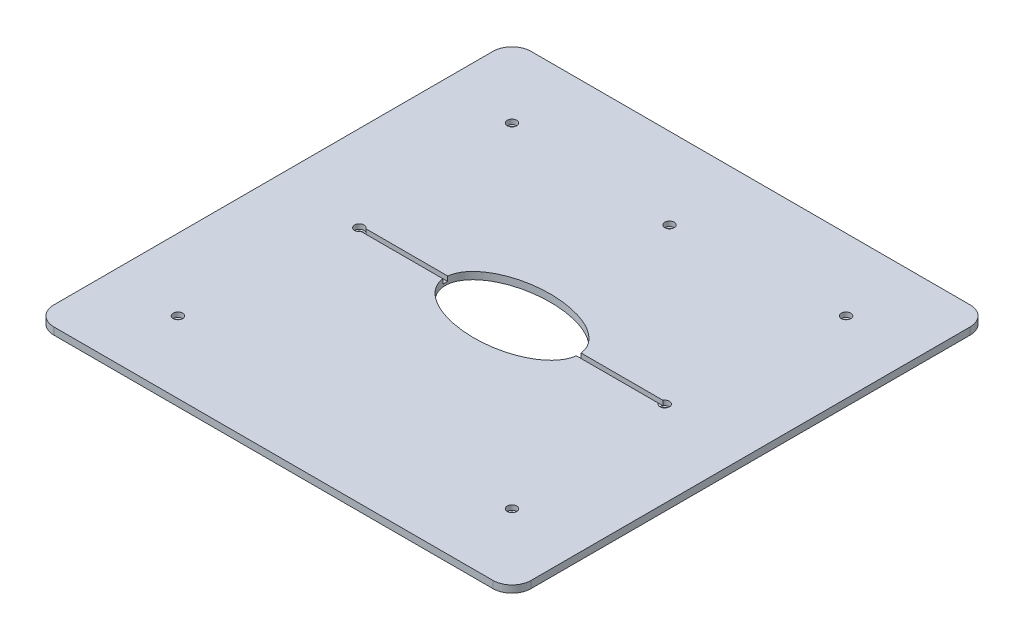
ISO-10303-21;
HEADER;
FILE_DESCRIPTION(('STEP AP214'),'2;1');
FILE_NAME('part.step','',(''),(''),'','','');
FILE_SCHEMA(('AUTOMOTIVE_DESIGN { 1 0 10303 214 1 1 1 1 }'));
ENDSEC;
DATA;
#1=APPLICATION_CONTEXT('core data for automotive mechanical design processes');
#2=APPLICATION_PROTOCOL_DEFINITION('international standard','automotive_design',2000,#1);
#3=PRODUCT_CONTEXT('',#1,'mechanical');
#4=PRODUCT('Part','Part','',(#3));
#5=PRODUCT_RELATED_PRODUCT_CATEGORY('part','',(#4));
#6=PRODUCT_DEFINITION_FORMATION('','',#4);
#7=PRODUCT_DEFINITION_CONTEXT('part definition',#1,'design');
#8=PRODUCT_DEFINITION('design','',#6,#7);
#9=PRODUCT_DEFINITION_SHAPE('','',#8);
#10=(LENGTH_UNIT() NAMED_UNIT(*) SI_UNIT(.MILLI.,.METRE.));
#11=(NAMED_UNIT(*) PLANE_ANGLE_UNIT() SI_UNIT($,.RADIAN.));
#12=(NAMED_UNIT(*) SI_UNIT($,.STERADIAN.) SOLID_ANGLE_UNIT());
#13=UNCERTAINTY_MEASURE_WITH_UNIT(LENGTH_MEASURE(1.E-05),#10,'distance_accuracy_value','');
#14=(GEOMETRIC_REPRESENTATION_CONTEXT(3) GLOBAL_UNCERTAINTY_ASSIGNED_CONTEXT((#13)) GLOBAL_UNIT_ASSIGNED_CONTEXT((#10,
#11,#12)) REPRESENTATION_CONTEXT('',''));
#15=CARTESIAN_POINT('',(0.,0.,0.));
#16=DIRECTION('',(0.,0.,1.));
#17=DIRECTION('',(1.,0.,0.));
#18=AXIS2_PLACEMENT_3D('',#15,#16,#17);
#19=CARTESIAN_POINT('',(-46.,1.5,46.));
#20=DIRECTION('',(0.,-1.,0.));
#21=DIRECTION('',(0.,0.,-1.));
#22=AXIS2_PLACEMENT_3D('',#19,#20,#21);
#23=CYLINDRICAL_SURFACE('',#22,4.);
#24=CARTESIAN_POINT('',(-46.,0.,46.));
#25=DIRECTION('',(0.,1.,0.));
#26=DIRECTION('',(0.,0.,-1.));
#27=AXIS2_PLACEMENT_3D('',#24,#25,#26);
#28=CIRCLE('',#27,4.);
#29=CARTESIAN_POINT('',(-50.,0.,46.));
#30=VERTEX_POINT('',#29);
#31=CARTESIAN_POINT('',(-45.9999999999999,0.,50.));
#32=VERTEX_POINT('',#31);
#33=EDGE_CURVE('E311',#30,#32,#28,.T.);
#34=ORIENTED_EDGE('',*,*,#33,.T.);
#35=DIRECTION('',(0.,-1.,0.));
#36=VECTOR('',#35,1.);
#37=CARTESIAN_POINT('',(-45.9999999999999,1.5,50.));
#38=LINE('',#37,#36);
#39=CARTESIAN_POINT('',(-45.9999999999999,1.5,50.));
#40=VERTEX_POINT('',#39);
#41=EDGE_CURVE('E305',#40,#32,#38,.T.);
#42=ORIENTED_EDGE('',*,*,#41,.F.);
#43=CARTESIAN_POINT('',(-46.,1.5,46.));
#44=DIRECTION('',(0.,1.,0.));
#45=DIRECTION('',(0.,0.,-1.));
#46=AXIS2_PLACEMENT_3D('',#43,#44,#45);
#47=CIRCLE('',#46,4.);
#48=CARTESIAN_POINT('',(-50.,1.5,46.));
#49=VERTEX_POINT('',#48);
#50=EDGE_CURVE('E333',#49,#40,#47,.T.);
#51=ORIENTED_EDGE('',*,*,#50,.F.);
#52=DIRECTION('',(0.,-1.,0.));
#53=VECTOR('',#52,1.);
#54=CARTESIAN_POINT('',(-50.,1.5,46.));
#55=LINE('',#54,#53);
#56=EDGE_CURVE('E334',#49,#30,#55,.T.);
#57=ORIENTED_EDGE('',*,*,#56,.T.);
#58=EDGE_LOOP('',(#34,#42,#51,#57));
#59=FACE_BOUND('',#58,.T.);
#60=ADVANCED_FACE('F41',(#59),#23,.T.);
#61=CARTESIAN_POINT('',(46.,1.5,50.));
#62=DIRECTION('',(0.,0.,-1.));
#63=DIRECTION('',(-1.,0.,0.));
#64=AXIS2_PLACEMENT_3D('',#61,#62,#63);
#65=PLANE('',#64);
#66=DIRECTION('',(1.,0.,0.));
#67=VECTOR('',#66,1.);
#68=CARTESIAN_POINT('',(46.,0.,50.));
#69=LINE('',#68,#67);
#70=CARTESIAN_POINT('',(46.,0.,50.));
#71=VERTEX_POINT('',#70);
#72=EDGE_CURVE('E300',#32,#71,#69,.T.);
#73=ORIENTED_EDGE('',*,*,#72,.T.);
#74=DIRECTION('',(0.,-1.,0.));
#75=VECTOR('',#74,1.);
#76=CARTESIAN_POINT('',(46.,1.5,50.));
#77=LINE('',#76,#75);
#78=CARTESIAN_POINT('',(46.,1.5,50.));
#79=VERTEX_POINT('',#78);
#80=EDGE_CURVE('E302',#79,#71,#77,.T.);
#81=ORIENTED_EDGE('',*,*,#80,.F.);
#82=DIRECTION('',(1.,0.,0.));
#83=VECTOR('',#82,1.);
#84=CARTESIAN_POINT('',(46.,1.5,50.));
#85=LINE('',#84,#83);
#86=EDGE_CURVE('E867',#40,#79,#85,.T.);
#87=ORIENTED_EDGE('',*,*,#86,.F.);
#88=ORIENTED_EDGE('',*,*,#41,.T.);
#89=EDGE_LOOP('',(#73,#81,#87,#88));
#90=FACE_BOUND('',#89,.T.);
#91=ADVANCED_FACE('F290',(#90),#65,.F.);
#92=CARTESIAN_POINT('',(46.,1.5,46.));
#93=DIRECTION('',(0.,-1.,0.));
#94=DIRECTION('',(0.,0.,-1.));
#95=AXIS2_PLACEMENT_3D('',#92,#93,#94);
#96=CYLINDRICAL_SURFACE('',#95,4.);
#97=CARTESIAN_POINT('',(46.,0.,46.));
#98=DIRECTION('',(0.,1.,0.));
#99=DIRECTION('',(0.,0.,1.));
#100=AXIS2_PLACEMENT_3D('',#97,#98,#99);
#101=CIRCLE('',#100,4.);
#102=CARTESIAN_POINT('',(50.,0.,46.));
#103=VERTEX_POINT('',#102);
#104=EDGE_CURVE('E310',#71,#103,#101,.T.);
#105=ORIENTED_EDGE('',*,*,#104,.T.);
#106=DIRECTION('',(0.,-1.,0.));
#107=VECTOR('',#106,1.);
#108=CARTESIAN_POINT('',(50.,1.5,46.));
#109=LINE('',#108,#107);
#110=CARTESIAN_POINT('',(50.,1.5,46.));
#111=VERTEX_POINT('',#110);
#112=EDGE_CURVE('E316',#111,#103,#109,.T.);
#113=ORIENTED_EDGE('',*,*,#112,.F.);
#114=CARTESIAN_POINT('',(46.,1.5,46.));
#115=DIRECTION('',(0.,1.,0.));
#116=DIRECTION('',(0.,0.,1.));
#117=AXIS2_PLACEMENT_3D('',#114,#115,#116);
#118=CIRCLE('',#117,4.);
#119=EDGE_CURVE('E315',#79,#111,#118,.T.);
#120=ORIENTED_EDGE('',*,*,#119,.F.);
#121=ORIENTED_EDGE('',*,*,#80,.T.);
#122=EDGE_LOOP('',(#105,#113,#120,#121));
#123=FACE_BOUND('',#122,.T.);
#124=ADVANCED_FACE('F287',(#123),#96,.T.);
#125=CARTESIAN_POINT('',(50.,1.5,46.));
#126=DIRECTION('',(-1.,0.,0.));
#127=DIRECTION('',(0.,0.,1.));
#128=AXIS2_PLACEMENT_3D('',#125,#126,#127);
#129=PLANE('',#128);
#130=DIRECTION('',(0.,0.,-1.));
#131=VECTOR('',#130,1.);
#132=CARTESIAN_POINT('',(50.,0.,46.));
#133=LINE('',#132,#131);
#134=CARTESIAN_POINT('',(50.,0.,-46.));
#135=VERTEX_POINT('',#134);
#136=EDGE_CURVE('E320',#103,#135,#133,.T.);
#137=ORIENTED_EDGE('',*,*,#136,.T.);
#138=DIRECTION('',(0.,-1.,0.));
#139=VECTOR('',#138,1.);
#140=CARTESIAN_POINT('',(50.,1.5,-46.));
#141=LINE('',#140,#139);
#142=CARTESIAN_POINT('',(50.,1.5,-46.));
#143=VERTEX_POINT('',#142);
#144=EDGE_CURVE('E347',#143,#135,#141,.T.);
#145=ORIENTED_EDGE('',*,*,#144,.F.);
#146=DIRECTION('',(0.,0.,-1.));
#147=VECTOR('',#146,1.);
#148=CARTESIAN_POINT('',(50.,1.5,46.));
#149=LINE('',#148,#147);
#150=EDGE_CURVE('E881',#111,#143,#149,.T.);
#151=ORIENTED_EDGE('',*,*,#150,.F.);
#152=ORIENTED_EDGE('',*,*,#112,.T.);
#153=EDGE_LOOP('',(#137,#145,#151,#152));
#154=FACE_BOUND('',#153,.T.);
#155=ADVANCED_FACE('F283',(#154),#129,.F.);
#156=CARTESIAN_POINT('',(46.,1.5,-46.));
#157=DIRECTION('',(0.,-1.,0.));
#158=DIRECTION('',(0.,0.,-1.));
#159=AXIS2_PLACEMENT_3D('',#156,#157,#158);
#160=CYLINDRICAL_SURFACE('',#159,4.);
#161=CARTESIAN_POINT('',(46.,0.,-46.));
#162=DIRECTION('',(0.,1.,0.));
#163=DIRECTION('',(0.,0.,-1.));
#164=AXIS2_PLACEMENT_3D('',#161,#162,#163);
#165=CIRCLE('',#164,4.);
#166=CARTESIAN_POINT('',(46.,0.,-50.));
#167=VERTEX_POINT('',#166);
#168=EDGE_CURVE('E322',#135,#167,#165,.T.);
#169=ORIENTED_EDGE('',*,*,#168,.T.);
#170=DIRECTION('',(0.,-1.,0.));
#171=VECTOR('',#170,1.);
#172=CARTESIAN_POINT('',(46.,1.5,-50.));
#173=LINE('',#172,#171);
#174=CARTESIAN_POINT('',(46.,1.5,-50.));
#175=VERTEX_POINT('',#174);
#176=EDGE_CURVE('E344',#175,#167,#173,.T.);
#177=ORIENTED_EDGE('',*,*,#176,.F.);
#178=CARTESIAN_POINT('',(46.,1.5,-46.));
#179=DIRECTION('',(0.,1.,0.));
#180=DIRECTION('',(0.,0.,-1.));
#181=AXIS2_PLACEMENT_3D('',#178,#179,#180);
#182=CIRCLE('',#181,4.);
#183=EDGE_CURVE('E879',#143,#175,#182,.T.);
#184=ORIENTED_EDGE('',*,*,#183,.F.);
#185=ORIENTED_EDGE('',*,*,#144,.T.);
#186=EDGE_LOOP('',(#169,#177,#184,#185));
#187=FACE_BOUND('',#186,.T.);
#188=ADVANCED_FACE('F279',(#187),#160,.T.);
#189=CARTESIAN_POINT('',(46.,1.5,-50.));
#190=DIRECTION('',(0.,0.,1.));
#191=DIRECTION('',(1.,0.,0.));
#192=AXIS2_PLACEMENT_3D('',#189,#190,#191);
#193=PLANE('',#192);
#194=DIRECTION('',(-1.,0.,0.));
#195=VECTOR('',#194,1.);
#196=CARTESIAN_POINT('',(46.,0.,-50.));
#197=LINE('',#196,#195);
#198=CARTESIAN_POINT('',(-45.9999999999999,0.,-50.));
#199=VERTEX_POINT('',#198);
#200=EDGE_CURVE('E327',#167,#199,#197,.T.);
#201=ORIENTED_EDGE('',*,*,#200,.T.);
#202=DIRECTION('',(0.,-1.,0.));
#203=VECTOR('',#202,1.);
#204=CARTESIAN_POINT('',(-45.9999999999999,1.5,-50.));
#205=LINE('',#204,#203);
#206=CARTESIAN_POINT('',(-45.9999999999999,1.5,-50.));
#207=VERTEX_POINT('',#206);
#208=EDGE_CURVE('E341',#207,#199,#205,.T.);
#209=ORIENTED_EDGE('',*,*,#208,.F.);
#210=DIRECTION('',(-1.,0.,0.));
#211=VECTOR('',#210,1.);
#212=CARTESIAN_POINT('',(46.,1.5,-50.));
#213=LINE('',#212,#211);
#214=EDGE_CURVE('E877',#175,#207,#213,.T.);
#215=ORIENTED_EDGE('',*,*,#214,.F.);
#216=ORIENTED_EDGE('',*,*,#176,.T.);
#217=EDGE_LOOP('',(#201,#209,#215,#216));
#218=FACE_BOUND('',#217,.T.);
#219=ADVANCED_FACE('F275',(#218),#193,.F.);
#220=CARTESIAN_POINT('',(-46.,1.5,-46.));
#221=DIRECTION('',(0.,-1.,0.));
#222=DIRECTION('',(0.,0.,-1.));
#223=AXIS2_PLACEMENT_3D('',#220,#221,#222);
#224=CYLINDRICAL_SURFACE('',#223,4.);
#225=CARTESIAN_POINT('',(-46.,0.,-46.));
#226=DIRECTION('',(0.,1.,0.));
#227=DIRECTION('',(0.,0.,-1.));
#228=AXIS2_PLACEMENT_3D('',#225,#226,#227);
#229=CIRCLE('',#228,4.);
#230=CARTESIAN_POINT('',(-50.,0.,-46.));
#231=VERTEX_POINT('',#230);
#232=EDGE_CURVE('E329',#199,#231,#229,.T.);
#233=ORIENTED_EDGE('',*,*,#232,.T.);
#234=DIRECTION('',(0.,-1.,0.));
#235=VECTOR('',#234,1.);
#236=CARTESIAN_POINT('',(-50.,1.5,-46.));
#237=LINE('',#236,#235);
#238=CARTESIAN_POINT('',(-50.,1.5,-46.));
#239=VERTEX_POINT('',#238);
#240=EDGE_CURVE('E337',#239,#231,#237,.T.);
#241=ORIENTED_EDGE('',*,*,#240,.F.);
#242=CARTESIAN_POINT('',(-46.,1.5,-46.));
#243=DIRECTION('',(0.,1.,0.));
#244=DIRECTION('',(0.,0.,-1.));
#245=AXIS2_PLACEMENT_3D('',#242,#243,#244);
#246=CIRCLE('',#245,4.);
#247=EDGE_CURVE('E875',#207,#239,#246,.T.);
#248=ORIENTED_EDGE('',*,*,#247,.F.);
#249=ORIENTED_EDGE('',*,*,#208,.T.);
#250=EDGE_LOOP('',(#233,#241,#248,#249));
#251=FACE_BOUND('',#250,.T.);
#252=ADVANCED_FACE('F271',(#251),#224,.T.);
#253=CARTESIAN_POINT('',(-50.,1.5,46.));
#254=DIRECTION('',(1.,0.,0.));
#255=DIRECTION('',(0.,0.,-1.));
#256=AXIS2_PLACEMENT_3D('',#253,#254,#255);
#257=PLANE('',#256);
#258=DIRECTION('',(0.,0.,1.));
#259=VECTOR('',#258,1.);
#260=CARTESIAN_POINT('',(-50.,0.,46.));
#261=LINE('',#260,#259);
#262=EDGE_CURVE('E331',#231,#30,#261,.T.);
#263=ORIENTED_EDGE('',*,*,#262,.T.);
#264=ORIENTED_EDGE('',*,*,#56,.F.);
#265=DIRECTION('',(0.,0.,1.));
#266=VECTOR('',#265,1.);
#267=CARTESIAN_POINT('',(-50.,1.5,46.));
#268=LINE('',#267,#266);
#269=EDGE_CURVE('E338',#239,#49,#268,.T.);
#270=ORIENTED_EDGE('',*,*,#269,.F.);
#271=ORIENTED_EDGE('',*,*,#240,.T.);
#272=EDGE_LOOP('',(#263,#264,#270,#271));
#273=FACE_BOUND('',#272,.T.);
#274=ADVANCED_FACE('F264',(#273),#257,.F.);
#275=CARTESIAN_POINT('',(-46.,1.5,46.));
#276=DIRECTION('',(0.,-1.,0.));
#277=DIRECTION('',(0.,0.,-1.));
#278=AXIS2_PLACEMENT_3D('',#275,#276,#277);
#279=PLANE('',#278);
#280=CARTESIAN_POINT('',(0.,1.5,-33.));
#281=DIRECTION('',(0.,1.,0.));
#282=DIRECTION('',(0.,0.,1.));
#283=AXIS2_PLACEMENT_3D('',#280,#281,#282);
#284=CIRCLE('',#283,1.);
#285=CARTESIAN_POINT('',(0.,1.5,-32.));
#286=VERTEX_POINT('',#285);
#287=EDGE_CURVE('E397',#286,#286,#284,.T.);
#288=ORIENTED_EDGE('',*,*,#287,.F.);
#289=EDGE_LOOP('',(#288));
#290=FACE_BOUND('',#289,.T.);
#291=DIRECTION('',(1.,0.,0.));
#292=VECTOR('',#291,1.);
#293=CARTESIAN_POINT('',(32.,1.5,0.499999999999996));
#294=LINE('',#293,#292);
#295=CARTESIAN_POINT('',(-31.1339745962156,1.5,0.500000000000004));
#296=VERTEX_POINT('',#295);
#297=CARTESIAN_POINT('',(-13.9726294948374,1.5,0.500000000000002));
#298=VERTEX_POINT('',#297);
#299=EDGE_CURVE('E193',#296,#298,#294,.T.);
#300=ORIENTED_EDGE('',*,*,#299,.F.);
#301=CARTESIAN_POINT('',(-32.,1.5,0.));
#302=DIRECTION('',(0.,1.,0.));
#303=DIRECTION('',(0.,0.,1.));
#304=AXIS2_PLACEMENT_3D('',#301,#302,#303);
#305=CIRCLE('',#304,1.);
#306=CARTESIAN_POINT('',(-31.1339745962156,1.5,-0.499999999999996));
#307=VERTEX_POINT('',#306);
#308=EDGE_CURVE('E163',#307,#296,#305,.T.);
#309=ORIENTED_EDGE('',*,*,#308,.F.);
#310=DIRECTION('',(-1.,0.,0.));
#311=VECTOR('',#310,1.);
#312=CARTESIAN_POINT('',(32.,1.5,-0.500000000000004));
#313=LINE('',#312,#311);
#314=CARTESIAN_POINT('',(-13.9726294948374,1.5,-0.499999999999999));
#315=VERTEX_POINT('',#314);
#316=EDGE_CURVE('E195',#315,#307,#313,.T.);
#317=ORIENTED_EDGE('',*,*,#316,.F.);
#318=CARTESIAN_POINT('',(0.,1.5,0.));
#319=DIRECTION('',(0.,1.,0.));
#320=DIRECTION('',(-1.,0.,0.));
#321=AXIS2_PLACEMENT_3D('',#318,#319,#320);
#322=ELLIPSE('',#321,14.,8.);
#323=CARTESIAN_POINT('',(13.9726294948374,1.5,-0.500000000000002));
#324=VERTEX_POINT('',#323);
#325=EDGE_CURVE('E192',#324,#315,#322,.T.);
#326=ORIENTED_EDGE('',*,*,#325,.F.);
#327=CARTESIAN_POINT('',(31.1339745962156,1.5,-0.500000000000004));
#328=VERTEX_POINT('',#327);
#329=EDGE_CURVE('E189',#328,#324,#313,.T.);
#330=ORIENTED_EDGE('',*,*,#329,.F.);
#331=CARTESIAN_POINT('',(32.,1.5,0.));
#332=DIRECTION('',(0.,1.,0.));
#333=DIRECTION('',(0.,0.,1.));
#334=AXIS2_PLACEMENT_3D('',#331,#332,#333);
#335=CIRCLE('',#334,0.999999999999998);
#336=CARTESIAN_POINT('',(31.1339745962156,1.5,0.499999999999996));
#337=VERTEX_POINT('',#336);
#338=EDGE_CURVE('E419',#337,#328,#335,.T.);
#339=ORIENTED_EDGE('',*,*,#338,.F.);
#340=CARTESIAN_POINT('',(13.9726294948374,1.5,0.499999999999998));
#341=VERTEX_POINT('',#340);
#342=EDGE_CURVE('E178',#341,#337,#294,.T.);
#343=ORIENTED_EDGE('',*,*,#342,.F.);
#344=EDGE_CURVE('E202',#298,#341,#322,.T.);
#345=ORIENTED_EDGE('',*,*,#344,.F.);
#346=EDGE_LOOP('',(#300,#309,#317,#326,#330,#339,#343,#345));
#347=FACE_BOUND('',#346,.T.);
#348=CARTESIAN_POINT('',(-35.0000000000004,1.5,34.9999999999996));
#349=DIRECTION('',(0.,1.,0.));
#350=DIRECTION('',(0.,0.,1.));
#351=AXIS2_PLACEMENT_3D('',#348,#349,#350);
#352=CIRCLE('',#351,0.999999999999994);
#353=CARTESIAN_POINT('',(-35.0000000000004,1.5,35.9999999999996));
#354=VERTEX_POINT('',#353);
#355=EDGE_CURVE('E366',#354,#354,#352,.T.);
#356=ORIENTED_EDGE('',*,*,#355,.F.);
#357=EDGE_LOOP('',(#356));
#358=FACE_BOUND('',#357,.T.);
#359=CARTESIAN_POINT('',(34.9999999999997,1.5,35.0000000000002));
#360=DIRECTION('',(0.,1.,0.));
#361=DIRECTION('',(0.,0.,1.));
#362=AXIS2_PLACEMENT_3D('',#359,#360,#361);
#363=CIRCLE('',#362,1.);
#364=CARTESIAN_POINT('',(34.9999999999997,1.5,36.0000000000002));
#365=VERTEX_POINT('',#364);
#366=EDGE_CURVE('E856',#365,#365,#363,.T.);
#367=ORIENTED_EDGE('',*,*,#366,.F.);
#368=EDGE_LOOP('',(#367));
#369=FACE_BOUND('',#368,.T.);
#370=CARTESIAN_POINT('',(35.0000000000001,1.5,-34.9999999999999));
#371=DIRECTION('',(0.,1.,0.));
#372=DIRECTION('',(0.,0.,1.));
#373=AXIS2_PLACEMENT_3D('',#370,#371,#372);
#374=CIRCLE('',#373,0.999999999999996);
#375=CARTESIAN_POINT('',(35.0000000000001,1.5,-33.9999999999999));
#376=VERTEX_POINT('',#375);
#377=EDGE_CURVE('E860',#376,#376,#374,.T.);
#378=ORIENTED_EDGE('',*,*,#377,.F.);
#379=EDGE_LOOP('',(#378));
#380=FACE_BOUND('',#379,.T.);
#381=CARTESIAN_POINT('',(-35.,1.5,-35.));
#382=DIRECTION('',(0.,1.,0.));
#383=DIRECTION('',(0.,0.,1.));
#384=AXIS2_PLACEMENT_3D('',#381,#382,#383);
#385=CIRCLE('',#384,0.999999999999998);
#386=CARTESIAN_POINT('',(-35.,1.5,-34.));
#387=VERTEX_POINT('',#386);
#388=EDGE_CURVE('E864',#387,#387,#385,.T.);
#389=ORIENTED_EDGE('',*,*,#388,.F.);
#390=EDGE_LOOP('',(#389));
#391=FACE_BOUND('',#390,.T.);
#392=ORIENTED_EDGE('',*,*,#50,.T.);
#393=ORIENTED_EDGE('',*,*,#86,.T.);
#394=ORIENTED_EDGE('',*,*,#119,.T.);
#395=ORIENTED_EDGE('',*,*,#150,.T.);
#396=ORIENTED_EDGE('',*,*,#183,.T.);
#397=ORIENTED_EDGE('',*,*,#214,.T.);
#398=ORIENTED_EDGE('',*,*,#247,.T.);
#399=ORIENTED_EDGE('',*,*,#269,.T.);
#400=EDGE_LOOP('',(#392,#393,#394,#395,#396,#397,#398,#399));
#401=FACE_BOUND('',#400,.T.);
#402=ADVANCED_FACE('F261',(#290,#347,#358,#369,#380,#391,#401),#279,.F.);
#403=CARTESIAN_POINT('',(-46.,0.,46.));
#404=DIRECTION('',(0.,-1.,0.));
#405=DIRECTION('',(0.,0.,-1.));
#406=AXIS2_PLACEMENT_3D('',#403,#404,#405);
#407=PLANE('',#406);
#408=CARTESIAN_POINT('',(0.,0.,-33.));
#409=DIRECTION('',(0.,-1.,0.));
#410=DIRECTION('',(0.,0.,-1.));
#411=AXIS2_PLACEMENT_3D('',#408,#409,#410);
#412=CIRCLE('',#411,0.805000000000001);
#413=CARTESIAN_POINT('',(0.,0.,-33.805));
#414=VERTEX_POINT('',#413);
#415=EDGE_CURVE('E395',#414,#414,#412,.T.);
#416=ORIENTED_EDGE('',*,*,#415,.F.);
#417=EDGE_LOOP('',(#416));
#418=FACE_BOUND('',#417,.T.);
#419=CARTESIAN_POINT('',(32.,0.,0.));
#420=DIRECTION('',(0.,-1.,0.));
#421=DIRECTION('',(0.,0.,-1.));
#422=AXIS2_PLACEMENT_3D('',#419,#420,#421);
#423=CIRCLE('',#422,0.805000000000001);
#424=CARTESIAN_POINT('',(32.,0.,-0.805000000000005));
#425=VERTEX_POINT('',#424);
#426=EDGE_CURVE('E394',#425,#425,#423,.T.);
#427=ORIENTED_EDGE('',*,*,#426,.F.);
#428=EDGE_LOOP('',(#427));
#429=FACE_BOUND('',#428,.T.);
#430=CARTESIAN_POINT('',(-32.,0.,0.));
#431=DIRECTION('',(0.,-1.,0.));
#432=DIRECTION('',(0.,0.,-1.));
#433=AXIS2_PLACEMENT_3D('',#430,#431,#432);
#434=CIRCLE('',#433,0.805000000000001);
#435=CARTESIAN_POINT('',(-32.,0.,-0.804999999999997));
#436=VERTEX_POINT('',#435);
#437=EDGE_CURVE('E414',#436,#436,#434,.T.);
#438=ORIENTED_EDGE('',*,*,#437,.F.);
#439=EDGE_LOOP('',(#438));
#440=FACE_BOUND('',#439,.T.);
#441=CARTESIAN_POINT('',(0.,0.,0.));
#442=DIRECTION('',(0.,1.,0.));
#443=DIRECTION('',(-1.,0.,0.));
#444=AXIS2_PLACEMENT_3D('',#441,#442,#443);
#445=ELLIPSE('',#444,14.,8.);
#446=CARTESIAN_POINT('',(-14.,0.,0.));
#447=VERTEX_POINT('',#446);
#448=EDGE_CURVE('E197',#447,#447,#445,.T.);
#449=ORIENTED_EDGE('',*,*,#448,.T.);
#450=EDGE_LOOP('',(#449));
#451=FACE_BOUND('',#450,.T.);
#452=CARTESIAN_POINT('',(-35.0000000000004,0.,34.9999999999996));
#453=DIRECTION('',(0.,-1.,0.));
#454=DIRECTION('',(0.,0.,-1.));
#455=AXIS2_PLACEMENT_3D('',#452,#453,#454);
#456=CIRCLE('',#455,0.805);
#457=CARTESIAN_POINT('',(-35.0000000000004,0.,34.1949999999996));
#458=VERTEX_POINT('',#457);
#459=EDGE_CURVE('E363',#458,#458,#456,.T.);
#460=ORIENTED_EDGE('',*,*,#459,.F.);
#461=EDGE_LOOP('',(#460));
#462=FACE_BOUND('',#461,.T.);
#463=CARTESIAN_POINT('',(34.9999999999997,0.,35.0000000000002));
#464=DIRECTION('',(0.,-1.,0.));
#465=DIRECTION('',(0.,0.,-1.));
#466=AXIS2_PLACEMENT_3D('',#463,#464,#465);
#467=CIRCLE('',#466,0.805);
#468=CARTESIAN_POINT('',(34.9999999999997,0.,34.1950000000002));
#469=VERTEX_POINT('',#468);
#470=EDGE_CURVE('E360',#469,#469,#467,.T.);
#471=ORIENTED_EDGE('',*,*,#470,.F.);
#472=EDGE_LOOP('',(#471));
#473=FACE_BOUND('',#472,.T.);
#474=CARTESIAN_POINT('',(35.0000000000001,0.,-34.9999999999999));
#475=DIRECTION('',(0.,-1.,0.));
#476=DIRECTION('',(0.,0.,-1.));
#477=AXIS2_PLACEMENT_3D('',#474,#475,#476);
#478=CIRCLE('',#477,0.805);
#479=CARTESIAN_POINT('',(35.0000000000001,0.,-35.8049999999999));
#480=VERTEX_POINT('',#479);
#481=EDGE_CURVE('E356',#480,#480,#478,.T.);
#482=ORIENTED_EDGE('',*,*,#481,.F.);
#483=EDGE_LOOP('',(#482));
#484=FACE_BOUND('',#483,.T.);
#485=CARTESIAN_POINT('',(-35.,0.,-35.));
#486=DIRECTION('',(0.,-1.,0.));
#487=DIRECTION('',(0.,0.,-1.));
#488=AXIS2_PLACEMENT_3D('',#485,#486,#487);
#489=CIRCLE('',#488,0.805000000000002);
#490=CARTESIAN_POINT('',(-35.,0.,-35.805));
#491=VERTEX_POINT('',#490);
#492=EDGE_CURVE('E353',#491,#491,#489,.T.);
#493=ORIENTED_EDGE('',*,*,#492,.F.);
#494=EDGE_LOOP('',(#493));
#495=FACE_BOUND('',#494,.T.);
#496=ORIENTED_EDGE('',*,*,#33,.F.);
#497=ORIENTED_EDGE('',*,*,#262,.F.);
#498=ORIENTED_EDGE('',*,*,#232,.F.);
#499=ORIENTED_EDGE('',*,*,#200,.F.);
#500=ORIENTED_EDGE('',*,*,#168,.F.);
#501=ORIENTED_EDGE('',*,*,#136,.F.);
#502=ORIENTED_EDGE('',*,*,#104,.F.);
#503=ORIENTED_EDGE('',*,*,#72,.F.);
#504=EDGE_LOOP('',(#496,#497,#498,#499,#500,#501,#502,#503));
#505=FACE_BOUND('',#504,.T.);
#506=ADVANCED_FACE('F259',(#418,#429,#440,#451,#462,#473,#484,#495,#505),#407,.T.);
#507=CARTESIAN_POINT('',(-35.,0.5,-35.));
#508=DIRECTION('',(0.,1.,0.));
#509=DIRECTION('',(0.,0.,1.));
#510=AXIS2_PLACEMENT_3D('',#507,#508,#509);
#511=CYLINDRICAL_SURFACE('',#510,0.999999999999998);
#512=CARTESIAN_POINT('',(-35.,0.5,-35.));
#513=DIRECTION('',(0.,1.,0.));
#514=DIRECTION('',(0.,0.,1.));
#515=AXIS2_PLACEMENT_3D('',#512,#513,#514);
#516=CIRCLE('',#515,1.00000000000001);
#517=CARTESIAN_POINT('',(-35.,0.5,-34.));
#518=VERTEX_POINT('',#517);
#519=EDGE_CURVE('E371',#518,#518,#516,.T.);
#520=ORIENTED_EDGE('',*,*,#519,.F.);
#521=EDGE_LOOP('',(#520));
#522=FACE_BOUND('',#521,.T.);
#523=ORIENTED_EDGE('',*,*,#388,.T.);
#524=EDGE_LOOP('',(#523));
#525=FACE_BOUND('',#524,.T.);
#526=ADVANCED_FACE('F249',(#522,#525),#511,.F.);
#527=CARTESIAN_POINT('',(35.0000000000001,0.5,-34.9999999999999));
#528=DIRECTION('',(0.,1.,0.));
#529=DIRECTION('',(0.,0.,1.));
#530=AXIS2_PLACEMENT_3D('',#527,#528,#529);
#531=CYLINDRICAL_SURFACE('',#530,0.999999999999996);
#532=CARTESIAN_POINT('',(35.0000000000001,0.5,-34.9999999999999));
#533=DIRECTION('',(0.,1.,0.));
#534=DIRECTION('',(0.,0.,1.));
#535=AXIS2_PLACEMENT_3D('',#532,#533,#534);
#536=CIRCLE('',#535,1.);
#537=CARTESIAN_POINT('',(35.0000000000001,0.5,-33.9999999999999));
#538=VERTEX_POINT('',#537);
#539=EDGE_CURVE('E890',#538,#538,#536,.T.);
#540=ORIENTED_EDGE('',*,*,#539,.F.);
#541=EDGE_LOOP('',(#540));
#542=FACE_BOUND('',#541,.T.);
#543=ORIENTED_EDGE('',*,*,#377,.T.);
#544=EDGE_LOOP('',(#543));
#545=FACE_BOUND('',#544,.T.);
#546=ADVANCED_FACE('F245',(#542,#545),#531,.F.);
#547=CARTESIAN_POINT('',(34.9999999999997,0.5,35.0000000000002));
#548=DIRECTION('',(0.,1.,0.));
#549=DIRECTION('',(0.,0.,1.));
#550=AXIS2_PLACEMENT_3D('',#547,#548,#549);
#551=CYLINDRICAL_SURFACE('',#550,1.);
#552=CARTESIAN_POINT('',(34.9999999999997,0.5,35.0000000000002));
#553=DIRECTION('',(0.,1.,0.));
#554=DIRECTION('',(0.,0.,1.));
#555=AXIS2_PLACEMENT_3D('',#552,#553,#554);
#556=CIRCLE('',#555,1.00000000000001);
#557=CARTESIAN_POINT('',(34.9999999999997,0.5,36.0000000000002));
#558=VERTEX_POINT('',#557);
#559=EDGE_CURVE('E893',#558,#558,#556,.T.);
#560=ORIENTED_EDGE('',*,*,#559,.F.);
#561=EDGE_LOOP('',(#560));
#562=FACE_BOUND('',#561,.T.);
#563=ORIENTED_EDGE('',*,*,#366,.T.);
#564=EDGE_LOOP('',(#563));
#565=FACE_BOUND('',#564,.T.);
#566=ADVANCED_FACE('F248',(#562,#565),#551,.F.);
#567=CARTESIAN_POINT('',(-35.0000000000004,0.5,34.9999999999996));
#568=DIRECTION('',(0.,1.,0.));
#569=DIRECTION('',(0.,0.,1.));
#570=AXIS2_PLACEMENT_3D('',#567,#568,#569);
#571=CYLINDRICAL_SURFACE('',#570,0.999999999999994);
#572=CARTESIAN_POINT('',(-35.0000000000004,0.5,34.9999999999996));
#573=DIRECTION('',(0.,1.,0.));
#574=DIRECTION('',(0.,0.,1.));
#575=AXIS2_PLACEMENT_3D('',#572,#573,#574);
#576=CIRCLE('',#575,1.);
#577=CARTESIAN_POINT('',(-35.0000000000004,0.5,35.9999999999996));
#578=VERTEX_POINT('',#577);
#579=EDGE_CURVE('E201',#578,#578,#576,.T.);
#580=ORIENTED_EDGE('',*,*,#579,.F.);
#581=EDGE_LOOP('',(#580));
#582=FACE_BOUND('',#581,.T.);
#583=ORIENTED_EDGE('',*,*,#355,.T.);
#584=EDGE_LOOP('',(#583));
#585=FACE_BOUND('',#584,.T.);
#586=ADVANCED_FACE('F243',(#582,#585),#571,.F.);
#587=CARTESIAN_POINT('',(-35.,-0.5,-35.));
#588=DIRECTION('',(0.,1.,0.));
#589=DIRECTION('',(0.,0.,1.));
#590=AXIS2_PLACEMENT_3D('',#587,#588,#589);
#591=CYLINDRICAL_SURFACE('',#590,0.805000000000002);
#592=CARTESIAN_POINT('',(-35.,0.304999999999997,-35.));
#593=DIRECTION('',(0.,1.,0.));
#594=DIRECTION('',(0.,0.,1.));
#595=AXIS2_PLACEMENT_3D('',#592,#593,#594);
#596=CIRCLE('',#595,0.805000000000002);
#597=CARTESIAN_POINT('',(-35.,0.304999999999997,-34.195));
#598=VERTEX_POINT('',#597);
#599=EDGE_CURVE('E357',#598,#598,#596,.T.);
#600=ORIENTED_EDGE('',*,*,#599,.T.);
#601=EDGE_LOOP('',(#600));
#602=FACE_BOUND('',#601,.T.);
#603=ORIENTED_EDGE('',*,*,#492,.T.);
#604=EDGE_LOOP('',(#603));
#605=FACE_BOUND('',#604,.T.);
#606=ADVANCED_FACE('F233',(#602,#605),#591,.F.);
#607=CARTESIAN_POINT('',(35.0000000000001,-0.5,-34.9999999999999));
#608=DIRECTION('',(0.,1.,0.));
#609=DIRECTION('',(0.,0.,1.));
#610=AXIS2_PLACEMENT_3D('',#607,#608,#609);
#611=CYLINDRICAL_SURFACE('',#610,0.805);
#612=CARTESIAN_POINT('',(35.0000000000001,0.304999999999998,-34.9999999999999));
#613=DIRECTION('',(0.,1.,0.));
#614=DIRECTION('',(0.,0.,1.));
#615=AXIS2_PLACEMENT_3D('',#612,#613,#614);
#616=CIRCLE('',#615,0.805);
#617=CARTESIAN_POINT('',(35.0000000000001,0.304999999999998,-34.1949999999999));
#618=VERTEX_POINT('',#617);
#619=EDGE_CURVE('E374',#618,#618,#616,.T.);
#620=ORIENTED_EDGE('',*,*,#619,.T.);
#621=EDGE_LOOP('',(#620));
#622=FACE_BOUND('',#621,.T.);
#623=ORIENTED_EDGE('',*,*,#481,.T.);
#624=EDGE_LOOP('',(#623));
#625=FACE_BOUND('',#624,.T.);
#626=ADVANCED_FACE('F229',(#622,#625),#611,.F.);
#627=CARTESIAN_POINT('',(34.9999999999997,-0.5,35.0000000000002));
#628=DIRECTION('',(0.,1.,0.));
#629=DIRECTION('',(0.,0.,1.));
#630=AXIS2_PLACEMENT_3D('',#627,#628,#629);
#631=CYLINDRICAL_SURFACE('',#630,0.805);
#632=CARTESIAN_POINT('',(34.9999999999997,0.304999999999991,35.0000000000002));
#633=DIRECTION('',(0.,1.,0.));
#634=DIRECTION('',(0.,0.,1.));
#635=AXIS2_PLACEMENT_3D('',#632,#633,#634);
#636=CIRCLE('',#635,0.805);
#637=CARTESIAN_POINT('',(34.9999999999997,0.304999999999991,35.8050000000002));
#638=VERTEX_POINT('',#637);
#639=EDGE_CURVE('E370',#638,#638,#636,.T.);
#640=ORIENTED_EDGE('',*,*,#639,.T.);
#641=EDGE_LOOP('',(#640));
#642=FACE_BOUND('',#641,.T.);
#643=ORIENTED_EDGE('',*,*,#470,.T.);
#644=EDGE_LOOP('',(#643));
#645=FACE_BOUND('',#644,.T.);
#646=ADVANCED_FACE('F232',(#642,#645),#631,.F.);
#647=CARTESIAN_POINT('',(-35.0000000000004,-0.5,34.9999999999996));
#648=DIRECTION('',(0.,1.,0.));
#649=DIRECTION('',(0.,0.,1.));
#650=AXIS2_PLACEMENT_3D('',#647,#648,#649);
#651=CYLINDRICAL_SURFACE('',#650,0.805);
#652=CARTESIAN_POINT('',(-35.0000000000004,0.304999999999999,34.9999999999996));
#653=DIRECTION('',(0.,1.,0.));
#654=DIRECTION('',(0.,0.,1.));
#655=AXIS2_PLACEMENT_3D('',#652,#653,#654);
#656=CIRCLE('',#655,0.805);
#657=CARTESIAN_POINT('',(-35.0000000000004,0.304999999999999,35.8049999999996));
#658=VERTEX_POINT('',#657);
#659=EDGE_CURVE('E367',#658,#658,#656,.T.);
#660=ORIENTED_EDGE('',*,*,#659,.T.);
#661=EDGE_LOOP('',(#660));
#662=FACE_BOUND('',#661,.T.);
#663=ORIENTED_EDGE('',*,*,#459,.T.);
#664=EDGE_LOOP('',(#663));
#665=FACE_BOUND('',#664,.T.);
#666=ADVANCED_FACE('F224',(#662,#665),#651,.F.);
#667=CARTESIAN_POINT('',(-35.0000000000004,0.5,34.9999999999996));
#668=DIRECTION('',(0.,1.,0.));
#669=DIRECTION('',(0.,0.,1.));
#670=AXIS2_PLACEMENT_3D('',#667,#668,#669);
#671=CONICAL_SURFACE('',#670,1.,0.78539816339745);
#672=ORIENTED_EDGE('',*,*,#579,.T.);
#673=EDGE_LOOP('',(#672));
#674=FACE_BOUND('',#673,.T.);
#675=ORIENTED_EDGE('',*,*,#659,.F.);
#676=EDGE_LOOP('',(#675));
#677=FACE_BOUND('',#676,.T.);
#678=ADVANCED_FACE('F220',(#674,#677),#671,.F.);
#679=CARTESIAN_POINT('',(34.9999999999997,0.5,35.0000000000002));
#680=DIRECTION('',(0.,1.,0.));
#681=DIRECTION('',(0.,0.,1.));
#682=AXIS2_PLACEMENT_3D('',#679,#680,#681);
#683=CONICAL_SURFACE('',#682,1.00000000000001,0.78539816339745);
#684=ORIENTED_EDGE('',*,*,#559,.T.);
#685=EDGE_LOOP('',(#684));
#686=FACE_BOUND('',#685,.T.);
#687=ORIENTED_EDGE('',*,*,#639,.F.);
#688=EDGE_LOOP('',(#687));
#689=FACE_BOUND('',#688,.T.);
#690=ADVANCED_FACE('F216',(#686,#689),#683,.F.);
#691=CARTESIAN_POINT('',(35.0000000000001,0.5,-34.9999999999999));
#692=DIRECTION('',(0.,1.,0.));
#693=DIRECTION('',(0.,0.,1.));
#694=AXIS2_PLACEMENT_3D('',#691,#692,#693);
#695=CONICAL_SURFACE('',#694,1.,0.78539816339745);
#696=ORIENTED_EDGE('',*,*,#539,.T.);
#697=EDGE_LOOP('',(#696));
#698=FACE_BOUND('',#697,.T.);
#699=ORIENTED_EDGE('',*,*,#619,.F.);
#700=EDGE_LOOP('',(#699));
#701=FACE_BOUND('',#700,.T.);
#702=ADVANCED_FACE('F213',(#698,#701),#695,.F.);
#703=CARTESIAN_POINT('',(-35.,0.5,-35.));
#704=DIRECTION('',(0.,1.,0.));
#705=DIRECTION('',(0.,0.,1.));
#706=AXIS2_PLACEMENT_3D('',#703,#704,#705);
#707=CONICAL_SURFACE('',#706,1.00000000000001,0.78539816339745);
#708=ORIENTED_EDGE('',*,*,#519,.T.);
#709=EDGE_LOOP('',(#708));
#710=FACE_BOUND('',#709,.T.);
#711=ORIENTED_EDGE('',*,*,#599,.F.);
#712=EDGE_LOOP('',(#711));
#713=FACE_BOUND('',#712,.T.);
#714=ADVANCED_FACE('F209',(#710,#713),#707,.F.);
#715=DIRECTION('',(0.,1.,0.));
#716=VECTOR('',#715,1.);
#717=SURFACE_OF_LINEAR_EXTRUSION('',#445,#716);
#718=CARTESIAN_POINT('',(0.,0.5,0.));
#719=DIRECTION('',(0.,1.,0.));
#720=DIRECTION('',(-1.,0.,0.));
#721=AXIS2_PLACEMENT_3D('',#718,#719,#720);
#722=ELLIPSE('',#721,14.,8.);
#723=CARTESIAN_POINT('',(13.9726294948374,0.5,-0.500000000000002));
#724=VERTEX_POINT('',#723);
#725=CARTESIAN_POINT('',(13.9726294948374,0.5,0.499999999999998));
#726=VERTEX_POINT('',#725);
#727=EDGE_CURVE('E380',#724,#726,#722,.F.);
#728=ORIENTED_EDGE('',*,*,#727,.F.);
#729=DIRECTION('',(0.,1.,0.));
#730=VECTOR('',#729,1.);
#731=CARTESIAN_POINT('',(13.9726294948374,0.,-0.500000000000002));
#732=LINE('',#731,#730);
#733=EDGE_CURVE('E49',#724,#324,#732,.T.);
#734=ORIENTED_EDGE('',*,*,#733,.T.);
#735=ORIENTED_EDGE('',*,*,#325,.T.);
#736=DIRECTION('',(0.,1.,0.));
#737=VECTOR('',#736,1.);
#738=CARTESIAN_POINT('',(-13.9726294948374,0.,-0.499999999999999));
#739=LINE('',#738,#737);
#740=CARTESIAN_POINT('',(-13.9726294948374,0.5,-0.499999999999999));
#741=VERTEX_POINT('',#740);
#742=EDGE_CURVE('E382',#315,#741,#739,.F.);
#743=ORIENTED_EDGE('',*,*,#742,.T.);
#744=CARTESIAN_POINT('',(-13.9726294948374,0.5,0.500000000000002));
#745=VERTEX_POINT('',#744);
#746=EDGE_CURVE('E352',#745,#741,#722,.F.);
#747=ORIENTED_EDGE('',*,*,#746,.F.);
#748=DIRECTION('',(0.,1.,0.));
#749=VECTOR('',#748,1.);
#750=CARTESIAN_POINT('',(-13.9726294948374,0.,0.500000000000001));
#751=LINE('',#750,#749);
#752=EDGE_CURVE('E183',#745,#298,#751,.T.);
#753=ORIENTED_EDGE('',*,*,#752,.T.);
#754=ORIENTED_EDGE('',*,*,#344,.T.);
#755=DIRECTION('',(0.,1.,0.));
#756=VECTOR('',#755,1.);
#757=CARTESIAN_POINT('',(13.9726294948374,0.,0.499999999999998));
#758=LINE('',#757,#756);
#759=EDGE_CURVE('E385',#341,#726,#758,.F.);
#760=ORIENTED_EDGE('',*,*,#759,.T.);
#761=EDGE_LOOP('',(#728,#734,#735,#743,#747,#753,#754,#760));
#762=FACE_BOUND('',#761,.T.);
#763=ORIENTED_EDGE('',*,*,#448,.F.);
#764=EDGE_LOOP('',(#763));
#765=FACE_BOUND('',#764,.T.);
#766=ADVANCED_FACE('F205',(#762,#765),#717,.F.);
#767=CARTESIAN_POINT('',(0.,0.5,0.));
#768=DIRECTION('',(0.,1.,0.));
#769=DIRECTION('',(0.,0.,1.));
#770=AXIS2_PLACEMENT_3D('',#767,#768,#769);
#771=PLANE('',#770);
#772=CARTESIAN_POINT('',(-32.,0.5,0.));
#773=DIRECTION('',(0.,1.,0.));
#774=DIRECTION('',(0.,0.,1.));
#775=AXIS2_PLACEMENT_3D('',#772,#773,#774);
#776=CIRCLE('',#775,0.999999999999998);
#777=CARTESIAN_POINT('',(-31.1339745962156,0.5,0.500000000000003));
#778=VERTEX_POINT('',#777);
#779=CARTESIAN_POINT('',(-31.1339745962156,0.5,-0.499999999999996));
#780=VERTEX_POINT('',#779);
#781=EDGE_CURVE('E159',#778,#780,#776,.T.);
#782=ORIENTED_EDGE('',*,*,#781,.F.);
#783=DIRECTION('',(1.,0.,0.));
#784=VECTOR('',#783,1.);
#785=CARTESIAN_POINT('',(32.,0.5,0.499999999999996));
#786=LINE('',#785,#784);
#787=EDGE_CURVE('E65',#778,#745,#786,.T.);
#788=ORIENTED_EDGE('',*,*,#787,.T.);
#789=ORIENTED_EDGE('',*,*,#746,.T.);
#790=DIRECTION('',(-1.,0.,0.));
#791=VECTOR('',#790,1.);
#792=CARTESIAN_POINT('',(32.,0.5,-0.500000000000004));
#793=LINE('',#792,#791);
#794=EDGE_CURVE('E168',#741,#780,#793,.T.);
#795=ORIENTED_EDGE('',*,*,#794,.T.);
#796=EDGE_LOOP('',(#782,#788,#789,#795));
#797=FACE_BOUND('',#796,.T.);
#798=ADVANCED_FACE('F166',(#797),#771,.T.);
#799=CARTESIAN_POINT('',(32.,0.5,0.499999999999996));
#800=DIRECTION('',(0.,0.,1.));
#801=DIRECTION('',(1.,0.,0.));
#802=AXIS2_PLACEMENT_3D('',#799,#800,#801);
#803=PLANE('',#802);
#804=ORIENTED_EDGE('',*,*,#787,.F.);
#805=DIRECTION('',(0.,1.,0.));
#806=VECTOR('',#805,1.);
#807=CARTESIAN_POINT('',(-31.1339745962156,0.5,0.500000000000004));
#808=LINE('',#807,#806);
#809=EDGE_CURVE('E173',#778,#296,#808,.T.);
#810=ORIENTED_EDGE('',*,*,#809,.T.);
#811=ORIENTED_EDGE('',*,*,#299,.T.);
#812=ORIENTED_EDGE('',*,*,#752,.F.);
#813=EDGE_LOOP('',(#804,#810,#811,#812));
#814=FACE_BOUND('',#813,.T.);
#815=ADVANCED_FACE('F181',(#814),#803,.F.);
#816=CARTESIAN_POINT('',(32.,0.5,-0.500000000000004));
#817=DIRECTION('',(0.,0.,-1.));
#818=DIRECTION('',(-1.,0.,0.));
#819=AXIS2_PLACEMENT_3D('',#816,#817,#818);
#820=PLANE('',#819);
#821=ORIENTED_EDGE('',*,*,#316,.T.);
#822=DIRECTION('',(0.,1.,0.));
#823=VECTOR('',#822,1.);
#824=CARTESIAN_POINT('',(-31.1339745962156,0.5,-0.499999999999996));
#825=LINE('',#824,#823);
#826=EDGE_CURVE('E11',#307,#780,#825,.F.);
#827=ORIENTED_EDGE('',*,*,#826,.T.);
#828=ORIENTED_EDGE('',*,*,#794,.F.);
#829=ORIENTED_EDGE('',*,*,#742,.F.);
#830=EDGE_LOOP('',(#821,#827,#828,#829));
#831=FACE_BOUND('',#830,.T.);
#832=ADVANCED_FACE('F460',(#831),#820,.F.);
#833=CARTESIAN_POINT('',(31.1339745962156,0.5,-0.500000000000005));
#834=VERTEX_POINT('',#833);
#835=EDGE_CURVE('E57',#834,#724,#793,.T.);
#836=ORIENTED_EDGE('',*,*,#835,.F.);
#837=DIRECTION('',(0.,1.,0.));
#838=VECTOR('',#837,1.);
#839=CARTESIAN_POINT('',(31.1339745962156,0.5,-0.500000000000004));
#840=LINE('',#839,#838);
#841=EDGE_CURVE('E179',#834,#328,#840,.T.);
#842=ORIENTED_EDGE('',*,*,#841,.T.);
#843=ORIENTED_EDGE('',*,*,#329,.T.);
#844=ORIENTED_EDGE('',*,*,#733,.F.);
#845=EDGE_LOOP('',(#836,#842,#843,#844));
#846=FACE_BOUND('',#845,.T.);
#847=ADVANCED_FACE('F427',(#846),#820,.F.);
#848=ORIENTED_EDGE('',*,*,#342,.T.);
#849=DIRECTION('',(0.,1.,0.));
#850=VECTOR('',#849,1.);
#851=CARTESIAN_POINT('',(31.1339745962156,0.5,0.499999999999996));
#852=LINE('',#851,#850);
#853=CARTESIAN_POINT('',(31.1339745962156,0.5,0.499999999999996));
#854=VERTEX_POINT('',#853);
#855=EDGE_CURVE('E162',#337,#854,#852,.F.);
#856=ORIENTED_EDGE('',*,*,#855,.T.);
#857=EDGE_CURVE('E185',#726,#854,#786,.T.);
#858=ORIENTED_EDGE('',*,*,#857,.F.);
#859=ORIENTED_EDGE('',*,*,#759,.F.);
#860=EDGE_LOOP('',(#848,#856,#858,#859));
#861=FACE_BOUND('',#860,.T.);
#862=ADVANCED_FACE('F211',(#861),#803,.F.);
#863=CARTESIAN_POINT('',(32.,0.5,0.));
#864=DIRECTION('',(0.,1.,0.));
#865=DIRECTION('',(0.,0.,1.));
#866=AXIS2_PLACEMENT_3D('',#863,#864,#865);
#867=CIRCLE('',#866,0.999999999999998);
#868=EDGE_CURVE('E170',#834,#854,#867,.T.);
#869=ORIENTED_EDGE('',*,*,#868,.F.);
#870=ORIENTED_EDGE('',*,*,#835,.T.);
#871=ORIENTED_EDGE('',*,*,#727,.T.);
#872=ORIENTED_EDGE('',*,*,#857,.T.);
#873=EDGE_LOOP('',(#869,#870,#871,#872));
#874=FACE_BOUND('',#873,.T.);
#875=ADVANCED_FACE('F445',(#874),#771,.T.);
#876=CARTESIAN_POINT('',(32.,0.5,0.));
#877=DIRECTION('',(0.,1.,0.));
#878=DIRECTION('',(0.,0.,1.));
#879=AXIS2_PLACEMENT_3D('',#876,#877,#878);
#880=CYLINDRICAL_SURFACE('',#879,0.999999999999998);
#881=CARTESIAN_POINT('',(32.,0.5,0.));
#882=DIRECTION('',(0.,1.,0.));
#883=DIRECTION('',(0.,0.,1.));
#884=AXIS2_PLACEMENT_3D('',#881,#882,#883);
#885=CIRCLE('',#884,0.999999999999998);
#886=EDGE_CURVE('E416',#854,#834,#885,.T.);
#887=ORIENTED_EDGE('',*,*,#886,.F.);
#888=ORIENTED_EDGE('',*,*,#855,.F.);
#889=ORIENTED_EDGE('',*,*,#338,.T.);
#890=ORIENTED_EDGE('',*,*,#841,.F.);
#891=EDGE_LOOP('',(#887,#888,#889,#890));
#892=FACE_BOUND('',#891,.T.);
#893=ADVANCED_FACE('F449',(#892),#880,.F.);
#894=CARTESIAN_POINT('',(-32.,0.5,0.));
#895=DIRECTION('',(0.,1.,0.));
#896=DIRECTION('',(0.,0.,1.));
#897=AXIS2_PLACEMENT_3D('',#894,#895,#896);
#898=CYLINDRICAL_SURFACE('',#897,1.);
#899=CARTESIAN_POINT('',(-32.,0.5,0.));
#900=DIRECTION('',(0.,1.,0.));
#901=DIRECTION('',(0.,0.,1.));
#902=AXIS2_PLACEMENT_3D('',#899,#900,#901);
#903=CIRCLE('',#902,1.);
#904=EDGE_CURVE('E156',#780,#778,#903,.T.);
#905=ORIENTED_EDGE('',*,*,#904,.F.);
#906=ORIENTED_EDGE('',*,*,#826,.F.);
#907=ORIENTED_EDGE('',*,*,#308,.T.);
#908=ORIENTED_EDGE('',*,*,#809,.F.);
#909=EDGE_LOOP('',(#905,#906,#907,#908));
#910=FACE_BOUND('',#909,.T.);
#911=ADVANCED_FACE('F174',(#910),#898,.F.);
#912=CARTESIAN_POINT('',(32.,-0.5,0.));
#913=DIRECTION('',(0.,1.,0.));
#914=DIRECTION('',(0.,0.,1.));
#915=AXIS2_PLACEMENT_3D('',#912,#913,#914);
#916=CYLINDRICAL_SURFACE('',#915,0.805000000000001);
#917=CARTESIAN_POINT('',(32.,0.305000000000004,0.));
#918=DIRECTION('',(0.,1.,0.));
#919=DIRECTION('',(0.,0.,1.));
#920=AXIS2_PLACEMENT_3D('',#917,#918,#919);
#921=CIRCLE('',#920,0.805000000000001);
#922=CARTESIAN_POINT('',(32.,0.305000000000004,0.804999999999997));
#923=VERTEX_POINT('',#922);
#924=EDGE_CURVE('E392',#923,#923,#921,.T.);
#925=ORIENTED_EDGE('',*,*,#924,.T.);
#926=EDGE_LOOP('',(#925));
#927=FACE_BOUND('',#926,.T.);
#928=ORIENTED_EDGE('',*,*,#426,.T.);
#929=EDGE_LOOP('',(#928));
#930=FACE_BOUND('',#929,.T.);
#931=ADVANCED_FACE('F456',(#927,#930),#916,.F.);
#932=CARTESIAN_POINT('',(-32.,-0.5,0.));
#933=DIRECTION('',(0.,1.,0.));
#934=DIRECTION('',(0.,0.,1.));
#935=AXIS2_PLACEMENT_3D('',#932,#933,#934);
#936=CYLINDRICAL_SURFACE('',#935,0.805000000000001);
#937=CARTESIAN_POINT('',(-32.,0.305000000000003,0.));
#938=DIRECTION('',(0.,1.,0.));
#939=DIRECTION('',(0.,0.,1.));
#940=AXIS2_PLACEMENT_3D('',#937,#938,#939);
#941=CIRCLE('',#940,0.805000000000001);
#942=CARTESIAN_POINT('',(-32.,0.305000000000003,0.805000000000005));
#943=VERTEX_POINT('',#942);
#944=EDGE_CURVE('E169',#943,#943,#941,.T.);
#945=ORIENTED_EDGE('',*,*,#944,.T.);
#946=EDGE_LOOP('',(#945));
#947=FACE_BOUND('',#946,.T.);
#948=ORIENTED_EDGE('',*,*,#437,.T.);
#949=EDGE_LOOP('',(#948));
#950=FACE_BOUND('',#949,.T.);
#951=ADVANCED_FACE('F523',(#947,#950),#936,.F.);
#952=CARTESIAN_POINT('',(-32.,0.5,0.));
#953=DIRECTION('',(0.,1.,0.));
#954=DIRECTION('',(0.,0.,1.));
#955=AXIS2_PLACEMENT_3D('',#952,#953,#954);
#956=CONICAL_SURFACE('',#955,0.999999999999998,0.78539816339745);
#957=ORIENTED_EDGE('',*,*,#781,.T.);
#958=ORIENTED_EDGE('',*,*,#904,.T.);
#959=EDGE_LOOP('',(#957,#958));
#960=FACE_BOUND('',#959,.T.);
#961=ORIENTED_EDGE('',*,*,#944,.F.);
#962=EDGE_LOOP('',(#961));
#963=FACE_BOUND('',#962,.T.);
#964=ADVANCED_FACE('F157',(#960,#963),#956,.F.);
#965=CARTESIAN_POINT('',(32.,0.5,0.));
#966=DIRECTION('',(0.,1.,0.));
#967=DIRECTION('',(0.,0.,1.));
#968=AXIS2_PLACEMENT_3D('',#965,#966,#967);
#969=CONICAL_SURFACE('',#968,0.999999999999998,0.78539816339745);
#970=ORIENTED_EDGE('',*,*,#868,.T.);
#971=ORIENTED_EDGE('',*,*,#886,.T.);
#972=EDGE_LOOP('',(#970,#971));
#973=FACE_BOUND('',#972,.T.);
#974=ORIENTED_EDGE('',*,*,#924,.F.);
#975=EDGE_LOOP('',(#974));
#976=FACE_BOUND('',#975,.T.);
#977=ADVANCED_FACE('F447',(#973,#976),#969,.F.);
#978=CARTESIAN_POINT('',(0.,0.5,-33.));
#979=DIRECTION('',(0.,1.,0.));
#980=DIRECTION('',(0.,0.,1.));
#981=AXIS2_PLACEMENT_3D('',#978,#979,#980);
#982=CYLINDRICAL_SURFACE('',#981,1.);
#983=CARTESIAN_POINT('',(0.,0.5,-33.));
#984=DIRECTION('',(0.,1.,0.));
#985=DIRECTION('',(0.,0.,1.));
#986=AXIS2_PLACEMENT_3D('',#983,#984,#985);
#987=CIRCLE('',#986,1.);
#988=CARTESIAN_POINT('',(0.,0.5,-32.));
#989=VERTEX_POINT('',#988);
#990=EDGE_CURVE('E403',#989,#989,#987,.T.);
#991=ORIENTED_EDGE('',*,*,#990,.F.);
#992=EDGE_LOOP('',(#991));
#993=FACE_BOUND('',#992,.T.);
#994=ORIENTED_EDGE('',*,*,#287,.T.);
#995=EDGE_LOOP('',(#994));
#996=FACE_BOUND('',#995,.T.);
#997=ADVANCED_FACE('F502',(#993,#996),#982,.F.);
#998=CARTESIAN_POINT('',(0.,-0.5,-33.));
#999=DIRECTION('',(0.,1.,0.));
#1000=DIRECTION('',(0.,0.,1.));
#1001=AXIS2_PLACEMENT_3D('',#998,#999,#1000);
#1002=CYLINDRICAL_SURFACE('',#1001,0.805000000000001);
#1003=CARTESIAN_POINT('',(0.,0.305,-33.));
#1004=DIRECTION('',(0.,1.,0.));
#1005=DIRECTION('',(0.,0.,1.));
#1006=AXIS2_PLACEMENT_3D('',#1003,#1004,#1005);
#1007=CIRCLE('',#1006,0.805000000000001);
#1008=CARTESIAN_POINT('',(0.,0.305,-32.195));
#1009=VERTEX_POINT('',#1008);
#1010=EDGE_CURVE('E44',#1009,#1009,#1007,.T.);
#1011=ORIENTED_EDGE('',*,*,#1010,.T.);
#1012=EDGE_LOOP('',(#1011));
#1013=FACE_BOUND('',#1012,.T.);
#1014=ORIENTED_EDGE('',*,*,#415,.T.);
#1015=EDGE_LOOP('',(#1014));
#1016=FACE_BOUND('',#1015,.T.);
#1017=ADVANCED_FACE('F493',(#1013,#1016),#1002,.F.);
#1018=CARTESIAN_POINT('',(0.,0.5,-33.));
#1019=DIRECTION('',(0.,1.,0.));
#1020=DIRECTION('',(0.,0.,1.));
#1021=AXIS2_PLACEMENT_3D('',#1018,#1019,#1020);
#1022=CONICAL_SURFACE('',#1021,1.,0.78539816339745);
#1023=ORIENTED_EDGE('',*,*,#990,.T.);
#1024=EDGE_LOOP('',(#1023));
#1025=FACE_BOUND('',#1024,.T.);
#1026=ORIENTED_EDGE('',*,*,#1010,.F.);
#1027=EDGE_LOOP('',(#1026));
#1028=FACE_BOUND('',#1027,.T.);
#1029=ADVANCED_FACE('F489',(#1025,#1028),#1022,.F.);
#1030=CLOSED_SHELL('',(#60,#91,#124,#155,#188,#219,#252,#274,#402,#506,#526,#546,#566,#586,#606,
#626,#646,#666,#678,#690,#702,#714,#766,#798,#815,#832,#847,#862,#875,#893,#911,#931,#951,#964,
#977,#997,#1017,#1029));
#1031=MANIFOLD_SOLID_BREP('B2',#1030);
#1032=ADVANCED_BREP_SHAPE_REPRESENTATION('',(#18,#1031),#14);
#1033=SHAPE_DEFINITION_REPRESENTATION(#9,#1032);
ENDSEC;
END-ISO-10303-21;
